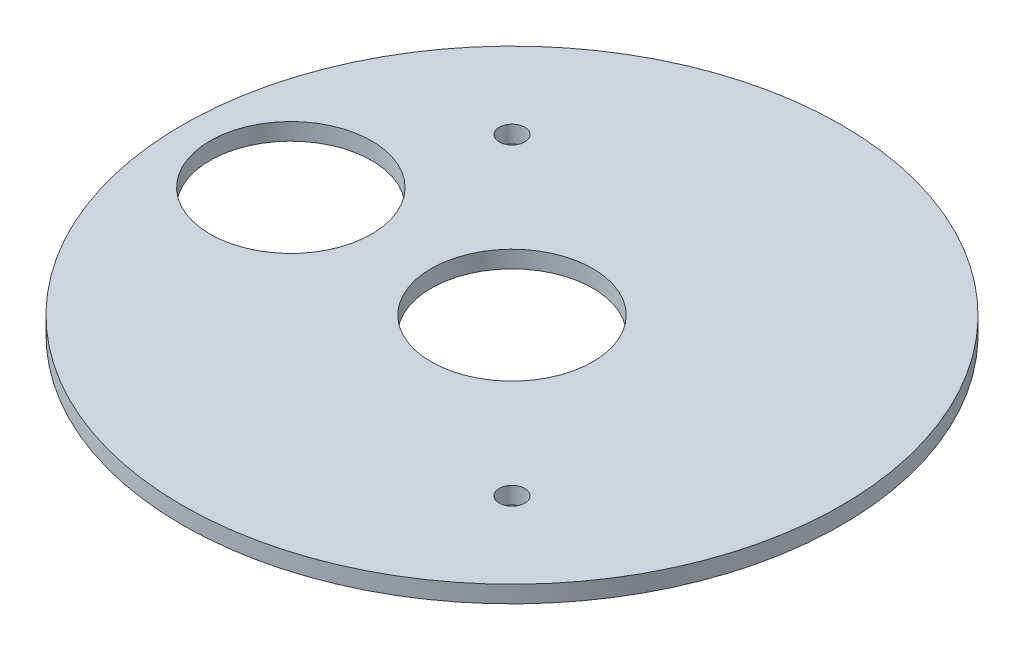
from build123d import *

# Parameters (mm, degrees)
SKETCH1_R           = 123
BOSS_EXTRUDE1_DEPTH = 6.35
SKETCH2_R           = 30.1625
CUT_EXTRUDE1_DEPTH  = 175.064133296
CUT_EXTRUDE2_REACH  = 176.064
SKETCH3_R           = 4.7625


with BuildPart() as part:
    # Sketch1 → Boss-Extrude1 (new body)
    with BuildSketch(Plane(origin=(0, 0, 0), x_dir=(1, 0, 0), z_dir=(0, 1, 0))):
        with Locations(Location((0, 0, 0), (0, 0, 270))):
            Circle(SKETCH1_R)
    extrude(amount=BOSS_EXTRUDE1_DEPTH)

    # Sketch2 → Cut-Extrude1 (cut, through all)
    with BuildSketch(Plane(origin=(0, 6.35, 0), x_dir=(1, 0, 0), z_dir=(0, 1, 0))):
        with Locations(Location((0, 0, 0), (0, 0, 270))):
            Circle(SKETCH2_R)
        with Locations(Location((-82.55, 0, 0), (0, 0, 270))):
            Circle(SKETCH2_R)
    extrude(amount=-CUT_EXTRUDE1_DEPTH, mode=Mode.SUBTRACT)

    # Sketch3 → Cut-Extrude2 (cut, up to next)
    with BuildSketch(Plane(origin=(0, 6.35, 0), x_dir=(1, 0, 0), z_dir=(0, 1, 0)), mode=Mode.PRIVATE) as cut_extrude2_sk1:
        with Locations(Location((58.371664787, -58.371664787, 0), (0, 0, 270))):
            Circle(SKETCH3_R)
    cut_extrude2_tool1 = extrude(cut_extrude2_sk1.sketch, amount=-CUT_EXTRUDE2_REACH, mode=Mode.PRIVATE) & part.part
    # Sketch3 → Cut-Extrude2 (cut, up to next)
    with BuildSketch(Plane(origin=(0, 6.35, 0), x_dir=(1, 0, 0), z_dir=(0, 1, 0)), mode=Mode.PRIVATE) as cut_extrude2_sk2:
        with Locations(Location((-58.371664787, 58.371664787, 0), (0, 0, 270))):
            Circle(SKETCH3_R)
    cut_extrude2_tool2 = extrude(cut_extrude2_sk2.sketch, amount=-CUT_EXTRUDE2_REACH, mode=Mode.PRIVATE) & part.part
    add(cut_extrude2_tool1.solids().sort_by_distance((58.371665, 6.35, 58.371665))[0], mode=Mode.SUBTRACT)
    add(cut_extrude2_tool2.solids().sort_by_distance((-58.371665, 6.35, -58.371665))[0], mode=Mode.SUBTRACT)


solid = part.part
